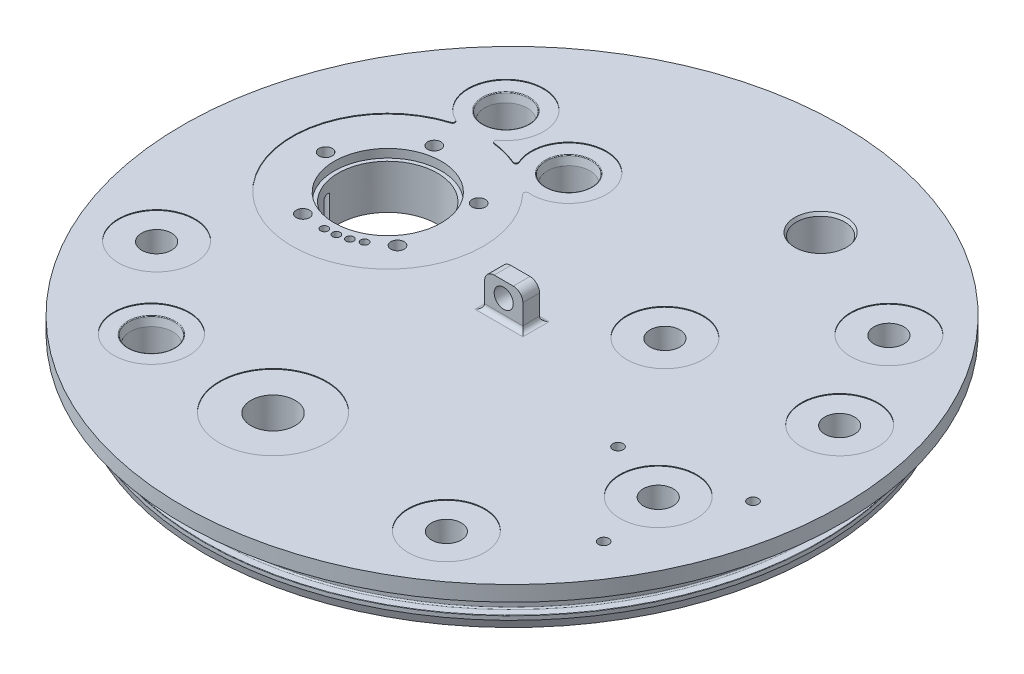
from build123d import *

# Parameters (mm, degrees)
SKETCH242_R                        = 3.175
BOSS_EXTRUDE1_DEPTH                = 2.778125
CTD_PORT_D                         = 33.02
CTD_PORT_CBORE_D                   = 35.56
CTD_PORT_CBORE_DEPTH               = 3.048
SKETCH237_R                        = 31.75
CUT_EXTRUDE1_DEPTH                 = 0.254
F_38_0_1015_DIAMETER_HOLE1_D       = 2.54
F_17_0_173_DIAMETER_HOLE1_D        = 4.3942
THREAD_FOR_ANTENNA_PORT_D          = 14.68374
ANTENNA_PORT_D                     = 6.7564
ANTENNA_PORT_CBORE_D               = 35.56
ANTENNA_PORT_CBORE_DEPTH           = 0.254
SUBCONN_SWAGELOK_PORTS_D           = 2.54
SUBCONN_SWAGELOK_PORTS_DEPTH       = 25.4
SUBCONN_SWAGELOK_PORTS_CBORE_D     = 25.4
SUBCONN_SWAGELOK_PORTS_CBORE_DEPTH = 0.254
F_7_16_20_TAPPED_HOLE1_D           = 9.92124
FILLET1_R                          = 0.762
FILLET2_R                          = 1.5875
F_8_32_TAPPED_HOLE1_D              = 3.4544
F_8_32_TAPPED_HOLE1_DEPTH          = 10.668
F_8_32_TAPPED_HOLE1_TIP            = 1.037806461
F_8_32_TAPPED_HOLE3_D              = 3.4544
F_8_32_TAPPED_HOLE3_DEPTH          = 10.668
F_8_32_TAPPED_HOLE3_TIP            = 1.037806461
CIRPATTERN1_COUNT                  = 12


with BuildPart() as part:
    # Sketch1 → Revolve1 (revolve)
    with BuildSketch(Plane.XY, mode=Mode.PRIVATE) as revolve1_sk:
        Polygon((0, 5.08), (-109.5375, 5.08), (-109.5375, 0), (-102.5779, 0), (-102.5779, -10.16), (-101.897309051, -12.7), (0, -12.7), align=None)
    revolve(revolve1_sk.sketch.rotate(Axis((0, -18.420388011, 0), (0, 1, 0)), 270), axis=Axis((0, -18.420388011, 0), (0, 1, 0)))

    # Sketch242 → Boss-Extrude1 (add, symmetric)
    with BuildSketch(Plane.XY):
        with BuildLine():
            Line((-3.175, 16.51), (3.175, 16.51))
            ThreePointArc((3.175, 16.51), (5.42006403, 15.58006403), (6.35, 13.335))
            Line((6.35, 13.335), (6.35, 5.08))
            Line((6.35, 5.08), (-6.35, 5.08))
            Line((-6.35, 5.08), (-6.35, 13.335))
            ThreePointArc((-6.35, 13.335), (-5.42006403, 15.58006403), (-3.175, 16.51))
        make_face()
        with Locations((0, 11.43)):
            Circle(SKETCH242_R, mode=Mode.SUBTRACT)
    extrude(amount=BOSS_EXTRUDE1_DEPTH, both=True)

    # Sketch234 → 2-265 O-Ring (revolve, cut)
    with BuildSketch(Plane.XY, mode=Mode.PRIVATE) as f_2_265_o_ring_sk:
        with BuildLine():
            Line((-102.4509, -3.94335), (-100.1776, -3.94335))
            ThreePointArc((-100.1776, -3.94335), (-99.863291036, -4.073541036), (-99.7331, -4.38785))
            Line((-99.7331, -4.38785), (-99.7331, -8.31215))
            ThreePointArc((-99.7331, -8.31215), (-99.863291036, -8.626458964), (-100.1776, -8.75665))
            Line((-100.1776, -8.75665), (-102.4509, -8.75665))
            ThreePointArc((-102.4509, -8.75665), (-102.540702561, -8.793847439), (-102.5779, -8.88365))
            Line((-102.5779, -8.88365), (-102.5779, -3.81635))
            ThreePointArc((-102.5779, -3.81635), (-102.540702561, -3.906152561), (-102.4509, -3.94335))
        make_face()
    revolve(f_2_265_o_ring_sk.sketch.rotate(Axis((0, 0, 0), (0, -1, 0)), 270), axis=Axis((0, 0, 0), (0, -1, 0)), mode=Mode.SUBTRACT)

    # CTD Port (through all)
    with Locations(Plane(origin=(0, 5.08, 0), x_dir=(1, 0, 0), z_dir=(0, 1, 0))):
        with Locations((-56.429386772, 15.120208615)):
            CounterBoreHole(CTD_PORT_D / 2, CTD_PORT_CBORE_D / 2, CTD_PORT_CBORE_DEPTH)

    # Sketch237 → Cut-Extrude1 (cut)
    with BuildSketch(Plane(origin=(0, 5.08, 0), x_dir=(1, 0, 0), z_dir=(0, 1, 0))):
        with Locations(Location((-56.429386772, 15.120208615, 0), (0, 0, 270))):
            Circle(SKETCH237_R)
    extrude(amount=-CUT_EXTRUDE1_DEPTH, mode=Mode.SUBTRACT)

    # 38 _0.1015_ Diameter Hole1 (through all)
    with Locations(Plane(origin=(0, 5.08, 0), x_dir=(1, 0, 0), z_dir=(0, 1, 0))):
        with Locations((-56.429386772, -5.961791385), (-52.76853589, -5.641508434), (-49.21891811, -4.690391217), (-45.888386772, -3.137338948)):
            Hole(F_38_0_1015_DIAMETER_HOLE1_D / 2)

    # 17 _0.173_ Diameter Hole1 (through all)
    with Locations(Plane(origin=(0, 5.08, 0), x_dir=(1, 0, 0), z_dir=(0, 1, 0))):
        with Locations((-62.083029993, 36.219892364), (-78.243450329, 16.263435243), (-64.257576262, -5.272922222), (-39.45341039, 1.373333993), (-38.109466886, 27.017303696)):
            Hole(F_17_0_173_DIAMETER_HOLE1_D / 2)

    # Port Sketch1 → SAE Port1 (revolve, cut)
    with BuildSketch(Plane(origin=(-57.135452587, 5.08, -58.135895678), x_dir=(-1, 0, 0), z_dir=(0, 0, 1)), mode=Mode.PRIVATE) as sae_port1_sk:
        with BuildLine():
            Line((3.057319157, 54.988507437), (9.605439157, 51.054))
            Line((9.605439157, 51.054), (9.605439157, 12.954))
            Line((9.605439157, 12.954), (10.201069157, 12.954))
            Line((10.201069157, 12.954), (10.201069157, 2.880662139))
            Line((10.201069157, 2.880662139), (10.127731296, 2.954))
            Line((10.127731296, 2.954), (10.658869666, 0.455190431))
            ThreePointArc((10.658869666, 0.455190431), (10.747471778, 0.310604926), (10.907319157, 0.254))
            Line((10.907319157, 0.254), (15.557319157, 0.254))
            Line((15.557319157, 0.254), (15.557319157, 0))
            Line((15.557319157, 0), (3.057319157, 0))
            Line((3.057319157, 0), (3.057319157, 54.988507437))
        make_face()
    revolve(sae_port1_sk.sketch.rotate(Axis((-60.192771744, 5.08, -58.135895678), (0, -1, 0)), 270), axis=Axis((-60.192771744, 5.08, -58.135895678), (0, -1, 0)), mode=Mode.SUBTRACT)

    # Port Sketch2 → SAE Port2 (revolve, cut)
    with BuildSketch(Plane(origin=(-29.371101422, 5.08, -52.515385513), x_dir=(-0.749432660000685, 0, 0.6620805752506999), z_dir=(0.6620805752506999, 0, 0.749432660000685)), mode=Mode.PRIVATE) as sae_port2_sk:
        with BuildLine():
            Line((3.057319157, 29.588507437), (9.605439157, 25.654))
            Line((9.605439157, 25.654), (9.605439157, 12.954))
            Line((9.605439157, 12.954), (10.201069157, 12.954))
            Line((10.201069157, 12.954), (10.201069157, 2.880662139))
            Line((10.201069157, 2.880662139), (10.127731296, 2.954))
            Line((10.127731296, 2.954), (10.658869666, 0.455190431))
            ThreePointArc((10.658869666, 0.455190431), (10.747471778, 0.310604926), (10.907319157, 0.254))
            Line((10.907319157, 0.254), (15.557319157, 0.254))
            Line((15.557319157, 0.254), (15.557319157, 0))
            Line((15.557319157, 0), (3.057319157, 0))
            Line((3.057319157, 0), (3.057319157, 29.588507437))
        make_face()
    revolve(sae_port2_sk.sketch.rotate(Axis((-31.66235625, 5.08, -50.491193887), (0, -1, 0)), 311.458742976), axis=Axis((-31.66235625, 5.08, -50.491193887), (0, -1, 0)), mode=Mode.SUBTRACT)

    # Port Sketch → SAE Port (revolve, cut)
    with BuildSketch(Plane(origin=(-53.602314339, 5.08, 65.77339864), x_dir=(-0.8796575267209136, 0, -0.47560764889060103), z_dir=(-0.47560764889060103, 0, 0.8796575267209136)), mode=Mode.PRIVATE) as sae_port_sk:
        with BuildLine():
            Line((1.241941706, 29.588507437), (7.790061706, 25.654))
            Line((7.790061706, 25.654), (7.790061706, 12.954))
            Line((7.790061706, 12.954), (8.385691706, 12.954))
            Line((8.385691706, 12.954), (8.385691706, 2.880662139))
            Line((8.385691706, 2.880662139), (8.312353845, 2.954))
            Line((8.312353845, 2.954), (8.843492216, 0.455190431))
            ThreePointArc((8.843492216, 0.455190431), (8.932094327, 0.310604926), (9.091941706, 0.254))
            Line((9.091941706, 0.254), (13.741941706, 0.254))
            Line((13.741941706, 0.254), (13.741941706, 0))
            Line((13.741941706, 0), (1.241941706, 0))
            Line((1.241941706, 0), (1.241941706, 29.588507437))
        make_face()
    revolve(sae_port_sk.sketch.rotate(Axis((-54.694797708, 5.08, 65.182721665), (0, -1, 0)), 241.601078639), axis=Axis((-54.694797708, 5.08, 65.182721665), (0, -1, 0)), mode=Mode.SUBTRACT)

    # Sketch41 → Optode Port (revolve, cut)
    with BuildSketch(Plane(origin=(27.365031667, -12.7, -75.184806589), x_dir=(0, 0, -1), z_dir=(1, 0, 0))):
        Polygon((0, 0), (0, 17.78), (8.606588, 17.78), (8.02, 16.763999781), (8.02, 0), align=None)
    revolve(axis=Axis((27.365031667, -19.05, -75.184806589), (0, 1, 0)), mode=Mode.SUBTRACT)

    # Thread For Antenna Port (through all)
    with Locations(Plane(origin=(0, 5.08, 0), x_dir=(1, 0, 0), z_dir=(0, 1, 0))):
        with Locations((-11.908792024, -67.538115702)):
            Hole(THREAD_FOR_ANTENNA_PORT_D / 2)

    # Antenna Port (through all)
    with Locations(Plane(origin=(0, 5.08, 0), x_dir=(1, 0, 0), z_dir=(0, 1, 0))):
        with Locations((-11.908792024, -67.538115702)):
            CounterBoreHole(ANTENNA_PORT_D / 2, ANTENNA_PORT_CBORE_D / 2, ANTENNA_PORT_CBORE_DEPTH)

    # Subconn _ Swagelok Ports
    with Locations(Plane(origin=(0, 5.08, 0), x_dir=(1, 0, 0), z_dir=(0, 1, 0))):
        with Locations((85.870805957, 23.00901311), (50.990945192, -72.822616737), (68.101350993, 57.143818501), (76.378216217, -27.79939725), (31.75, 19.05), (-80.570762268, -37.570763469)):
            CounterBoreHole(SUBCONN_SWAGELOK_PORTS_D / 2, SUBCONN_SWAGELOK_PORTS_CBORE_D / 2, SUBCONN_SWAGELOK_PORTS_CBORE_DEPTH, depth=SUBCONN_SWAGELOK_PORTS_DEPTH)

    # 7_16-20 Tapped Hole1 (through all)
    with Locations(Plane(origin=(0, 5.08, 0), x_dir=(1, 0, 0), z_dir=(0, 1, 0))):
        with Locations((50.990945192, -72.822616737), (68.101350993, 57.143818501), (76.378216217, -27.79939725), (85.870805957, 23.00901311), (31.75, 19.05), (-80.570762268, -37.570763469)):
            Hole(F_7_16_20_TAPPED_HOLE1_D / 2)

    # Fillet1
    fillet1_edges = [part.edges().sort_by_distance(p)[0] for p in [
        (-54.858313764, 4.953, -46.831314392),
        (-63.48316738, 4.953, -46.076737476),
        (-34.842369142, 4.953, -38.402458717),
        (-41.934423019, 4.953, -43.368368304),
    ]]
    fillet(fillet1_edges, radius=FILLET1_R)

    # Fillet2
    fillet2_edges = [part.edges().sort_by_distance(p)[0] for p in [
        (0, 5.08, 2.778125),
        (0, 5.08, -2.778125),
        (-6.35, 5.08, 0),
        (6.35, 5.08, 0),
    ]]
    fillet(fillet2_edges, radius=FILLET2_R)

    # 8-32 Tapped Hole1
    with Locations(Plane(origin=(0, -12.7, 0), x_dir=(-1, 0, 0), z_dir=(0, -1, 0))):
        with Locations((-62.805821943, 32.369860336), (-60.062761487, 43.465828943), (-71.158730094, 46.2088894), (70.654022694, -0.623061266), (73.39708315, 10.472907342), (84.493051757, 7.729846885)):
            Hole(F_8_32_TAPPED_HOLE1_D / 2, depth=F_8_32_TAPPED_HOLE1_DEPTH)
            with Locations((0, 0, -(F_8_32_TAPPED_HOLE1_DEPTH + F_8_32_TAPPED_HOLE1_TIP / 2))):  # 118° drill point
                Cone(0, F_8_32_TAPPED_HOLE1_D / 2, F_8_32_TAPPED_HOLE1_TIP, mode=Mode.SUBTRACT)

    # Sketch247 → 8-32 Tapped Hole2 (revolve, cut)
    with BuildSketch(Plane(origin=(75.910035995, -12.7, 6.641267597), x_dir=(0, 0, -1), z_dir=(1, 0, 0))):
        Polygon((0, 0), (0, 11.705806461), (1.7272, 10.668), (1.7272, 0), align=None)
    f_8_32_tapped_hole2 = revolve(axis=Axis((75.910035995, -19.05, 6.641267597), (0, 1, 0)), mode=Mode.SUBTRACT)

    # 8-32 Tapped Hole3
    with Locations(Plane(origin=(0, 5.08, 0), x_dir=(1, 0, 0), z_dir=(0, 1, 0))):
        with Locations((80.259600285, -49.811820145), (93.50084161, -13.431808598), (55.374206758, -20.154563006)):
            Hole(F_8_32_TAPPED_HOLE3_D / 2, depth=F_8_32_TAPPED_HOLE3_DEPTH)
            with Locations((0, 0, -(F_8_32_TAPPED_HOLE3_DEPTH + F_8_32_TAPPED_HOLE3_TIP / 2))):  # 118° drill point
                Cone(0, F_8_32_TAPPED_HOLE3_D / 2, F_8_32_TAPPED_HOLE3_TIP, mode=Mode.SUBTRACT)

    # CirPattern1: 8-32 Tapped Hole2 ×12 about axis, 5 skipped
    cirpattern1_axis = Axis((0, 0, 0), (0, -1, 0))
    add([f_8_32_tapped_hole2.rotate(cirpattern1_axis, i * 360 / CIRPATTERN1_COUNT) for i in range(1, CIRPATTERN1_COUNT) if i not in (3, 4, 6, 7, 9)], mode=Mode.SUBTRACT)


solid = part.part
